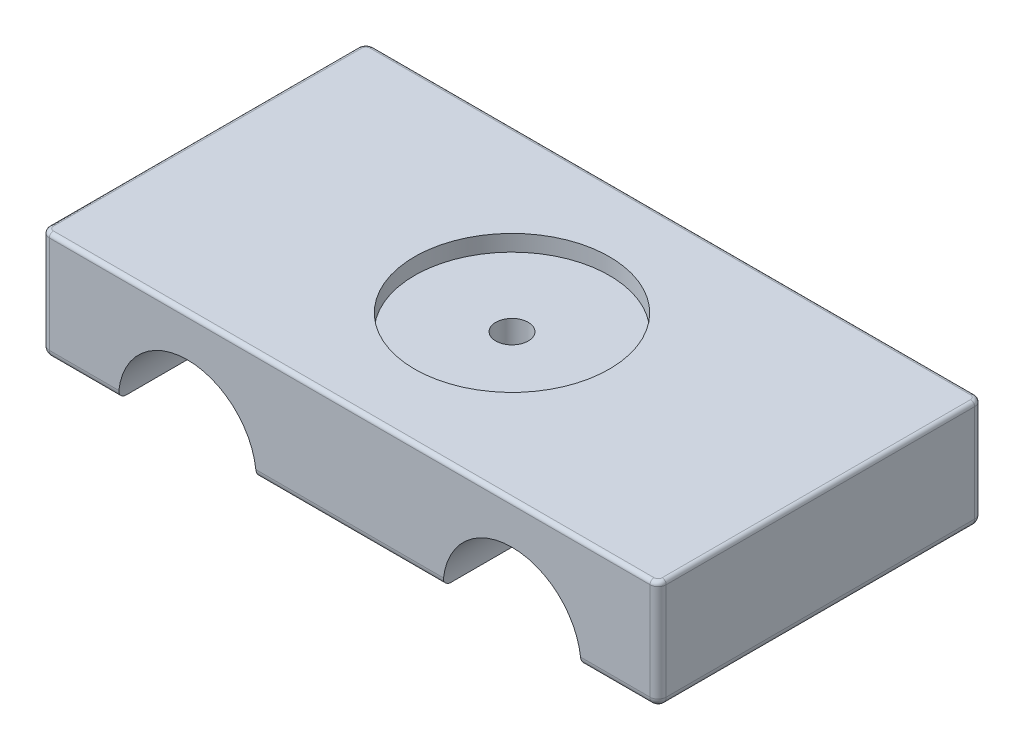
from build123d import *

# Parameters (mm, degrees)
BOSS_EXTRUDE1_DEPTH = 508
FILLET1_R           = 12.7
SKETCH2_R           = 7.62
CUT_EXTRUDE1_DEPTH  = 132.08
SKETCH3_W           = 265.176
SKETCH3_H           = 455.676
CUT_EXTRUDE2_DEPTH  = 88.9
SKETCH4_W           = 81.026
SKETCH4_H           = 455.676
CUT_EXTRUDE3_DEPTH  = 157.988
SKETCH5_W           = 81.026
SKETCH5_H           = 455.676
CUT_EXTRUDE4_DEPTH  = 72.898
FILLET3_R           = 6.35
CUT_EXTRUDE5_DEPTH  = 76.2
SKETCH8_R           = 152.4
CUT_EXTRUDE6_DEPTH  = 25.4


with BuildPart() as part:
    # Sketch1 → Boss-Extrude1 (new body)
    with BuildSketch(Plane.XY):
        with BuildLine():
            Line((0, 96.4), (0, -40.108885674))
            Line((0, -40.108885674), (0, -62.3))
            ThreePointArc((0, -62.3), (3.719743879, -71.280256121), (12.7, -75))
            Line((12.7, -75), (120.65, -75))
            ThreePointArc((120.65, -75), (228.6, 32.95), (336.55, -75))
            Line((336.55, -75), (628.65, -75))
            ThreePointArc((628.65, -75), (736.6, 32.95), (844.55, -75))
            Line((844.55, -75), (952.5, -75))
            ThreePointArc((952.5, -75), (961.480256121, -71.280256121), (965.2, -62.3))
            Line((965.2, -62.3), (965.2, 25))
            Line((965.2, 25), (965.2, 96.4))
            Line((965.2, 96.4), (0, 96.4))
        make_face()
    extrude(amount=BOSS_EXTRUDE1_DEPTH)

    # Fillet1
    fillet1_edges = [part.edges().sort_by_distance(p)[0] for p in [
        (961.480256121, -71.280256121, 508),
        (482.6, -75, 0),
        (66.675, -75, 0),
        (3.719743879, -71.280256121, 0),
        (0, 17.05, 0),
        (965.2, 17.05, 0),
        (961.480256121, -71.280256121, 0),
        (965.2, 17.05, 508),
        (898.525, -75, 0),
        (0, 17.05, 508),
        (3.719743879, -71.280256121, 508),
        (66.675, -75, 508),
        (482.6, -75, 508),
        (898.525, -75, 508),
    ]]
    fillet(fillet1_edges, radius=FILLET1_R)

    # Sketch2 → Cut-Extrude1 (cut)
    with BuildSketch(Plane.XZ.offset(75)):
        with Locations(Location((228.6, 469.9, 0), (0, 0, 270))):
            Circle(SKETCH2_R)
        with Locations(Location((228.6, 38.1, 0), (0, 0, 270))):
            Circle(SKETCH2_R)
        with Locations(Location((736.6, 469.9, 0), (0, 0, 270))):
            Circle(SKETCH2_R)
        with Locations(Location((736.6, 38.1, 0), (0, 0, 270))):
            Circle(SKETCH2_R)
    extrude(amount=-CUT_EXTRUDE1_DEPTH, mode=Mode.SUBTRACT)

    # Sketch3 → Cut-Extrude2 (cut)
    with BuildSketch(Plane.XZ.offset(75)):
        with Locations((482.6, 254)):
            Rectangle(SKETCH3_W, SKETCH3_H)
    extrude(amount=-CUT_EXTRUDE2_DEPTH, mode=Mode.SUBTRACT)

    # Sketch4 → Cut-Extrude3 (cut)
    with BuildSketch(Plane.XZ.offset(75)):
        with Locations((898.525, 254)):
            Rectangle(SKETCH4_W, SKETCH4_H)
    extrude(amount=-CUT_EXTRUDE3_DEPTH, mode=Mode.SUBTRACT)

    # Sketch5 → Cut-Extrude4 (cut)
    with BuildSketch(Plane.XZ.offset(75)):
        with Locations((66.675, 254)):
            Rectangle(SKETCH5_W, SKETCH5_H)
    extrude(amount=-CUT_EXTRUDE4_DEPTH, mode=Mode.SUBTRACT)

    # Fillet3
    fillet3_edges = [part.edges().sort_by_distance(p)[0] for p in [
        (482.6, 96.4, 0),
        (0, 96.4, 254),
        (482.6, 96.4, 508),
        (965.2, 96.4, 254),
        (3.719743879, 96.4, 504.280256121),
        (961.480256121, 96.4, 504.280256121),
        (961.480256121, 96.4, 3.719743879),
        (3.719743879, 96.4, 3.719743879),
    ]]
    fillet(fillet3_edges, radius=FILLET3_R)

    # Sketch7 → Cut-Extrude5 (cut)
    with BuildSketch(Plane(origin=(0, 96.4, 0), x_dir=(1, 0, 0), z_dir=(0, 1, 0))):
        with BuildLine():
            ThreePointArc((508, -254), (500.560512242, -236.039487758), (482.6, -228.6))
            Line((482.6, -228.6), (482.6, -279.4))
            ThreePointArc((482.6, -279.4), (500.560512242, -271.960512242), (508, -254))
        make_face()
        with BuildLine():
            Line((482.6, -279.4), (482.6, -228.6))
            ThreePointArc((482.6, -228.6), (457.2, -254), (482.6, -279.4))
        make_face()
        with BuildLine():
            ThreePointArc((508, -254), (500.560512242, -236.039487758), (482.6, -228.6))
            Line((482.6, -228.6), (482.6, -279.4))
            ThreePointArc((482.6, -279.4), (500.560512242, -271.960512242), (508, -254))
        make_face()
        with BuildLine():
            Line((482.6, -279.4), (482.6, -228.6))
            ThreePointArc((482.6, -228.6), (457.2, -254), (482.6, -279.4))
        make_face()
    extrude(amount=-CUT_EXTRUDE5_DEPTH, mode=Mode.SUBTRACT)

    # Sketch8 → Cut-Extrude6 (cut)
    with BuildSketch(Plane(origin=(0, 96.4, 0), x_dir=(1, 0, 0), z_dir=(0, 1, 0))):
        with Locations(Location((482.6, -254, 0), (0, 0, 270))):
            Circle(SKETCH8_R)
    extrude(amount=-CUT_EXTRUDE6_DEPTH, mode=Mode.SUBTRACT)


solid = part.part
